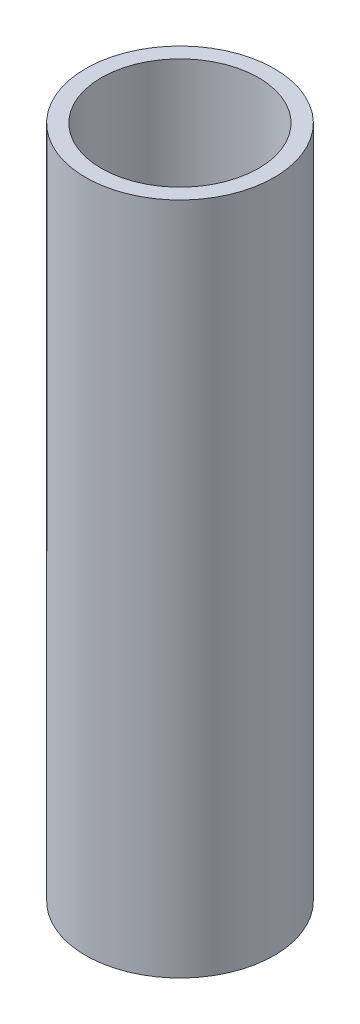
from build123d import *

# Parameters (mm, degrees)
SKETCH_1_R      = 12.6
SKETCH_1_R_2    = 10.5
EXTRUDE_1_DEPTH = 90


with BuildPart() as part:
    # Sketch 1 → Extrude 1 (new body)
    with BuildSketch(Plane(origin=(0, 0, 0), x_dir=(1, 0, 0), z_dir=(0, 1, 0))):
        with Locations(Location((0, 0, 0), (0, 0, 90))):
            Circle(SKETCH_1_R)
        with Locations(Location((0, 0, 0), (0, 0, 90))):
            Circle(SKETCH_1_R_2, mode=Mode.SUBTRACT)
    extrude(amount=EXTRUDE_1_DEPTH)


solid = part.part
